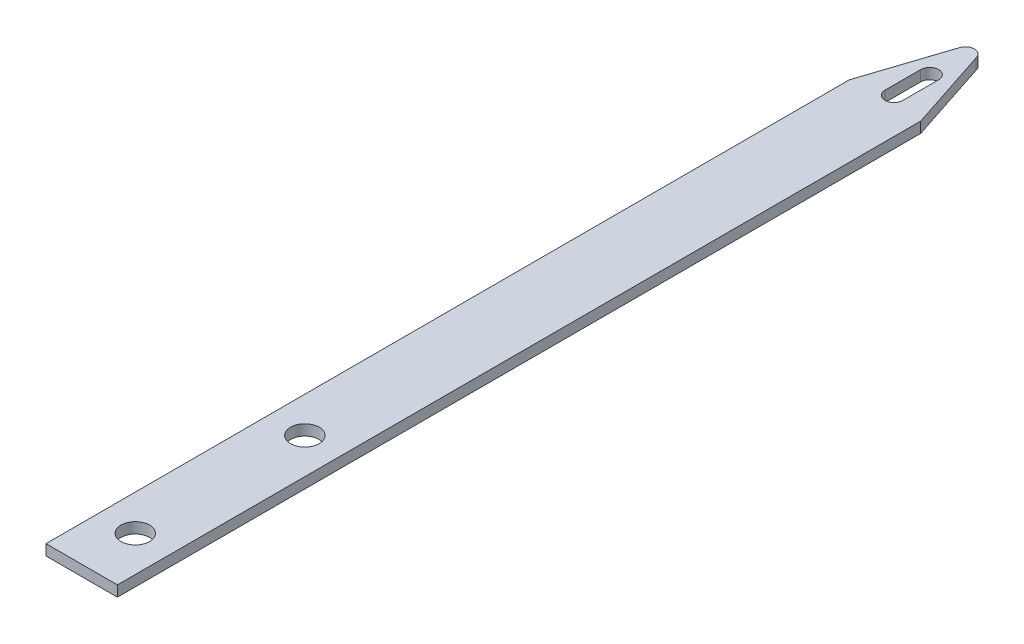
from build123d import *

# Parameters (mm, degrees)
EXTRUDE1_DEPTH      = 20
EXTRUDE1_DEPTH_BACK = 20
SKETCH1_W           = 4
SKETCH1_H           = 0.6
SKETCH2_R           = 0.8
CUT_EXTRUDE1_DEPTH  = 21.404901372
SKETCH3_W           = 4
SKETCH3_H           = 0.6
EXTRUDE2_DEPTH      = 10
SKETCH4_R           = 0.8
CUT_EXTRUDE2_DEPTH  = 31.271438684


with BuildPart() as part:
    # Sketch1 → Extrude1 (new, two sides: drawn at the far end of the back side and taken through both)
    with BuildSketch(Plane.XY.offset(-EXTRUDE1_DEPTH_BACK)):
        with Locations((2, 0.3)):
            Rectangle(SKETCH1_W, SKETCH1_H)
    extrude(amount=EXTRUDE1_DEPTH + EXTRUDE1_DEPTH_BACK)

    # Sketch2 → Cut-Extrude1 (cut, through all)
    with BuildSketch(Plane(origin=(0, 0.6, 0), x_dir=(1, 0, 0), z_dir=(0, 1, 0))):
        with BuildLine():
            Line((1.5, 17.5), (1.5, 15.5))
            ThreePointArc((1.5, 15.5), (2, 15), (2.5, 15.5))
            Line((2.5, 15.5), (2.5, 17.5))
            ThreePointArc((2.5, 17.5), (2, 18), (1.5, 17.5))
        make_face()
        with BuildLine():
            Line((0, 20), (0, 15))
            Line((0, 15), (1.524836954, 19.655628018))
            ThreePointArc((1.524836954, 19.655628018), (1.706583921, 19.9048543), (2, 20))
            Line((2, 20), (0, 20))
        make_face()
        with BuildLine():
            Line((2.490312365, 19.59794787), (4, 15))
            Line((4, 15), (4, 20))
            Line((4, 20), (2, 20))
            ThreePointArc((2, 20), (2.317037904, 19.886635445), (2.490312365, 19.59794787))
        make_face()
        with Locations(Location((2, -17.5, 0), (0, 0, 90))):
            Circle(SKETCH2_R)
    extrude(amount=-CUT_EXTRUDE1_DEPTH, mode=Mode.SUBTRACT)

    # Sketch3 → Extrude2 (add)
    with BuildSketch(Plane.XY.offset(20)):
        with Locations((2, 0.3)):
            Rectangle(SKETCH3_W, SKETCH3_H)
    extrude(amount=EXTRUDE2_DEPTH)

    # Sketch4 → Cut-Extrude2 (cut, through all)
    with BuildSketch(Plane(origin=(0, 0.6, 0), x_dir=(1, 0, 0), z_dir=(0, 1, 0))):
        with Locations(Location((2, -27, 0), (0, 0, 270))):
            Circle(SKETCH4_R)
    extrude(amount=-CUT_EXTRUDE2_DEPTH, mode=Mode.SUBTRACT)


solid = part.part
